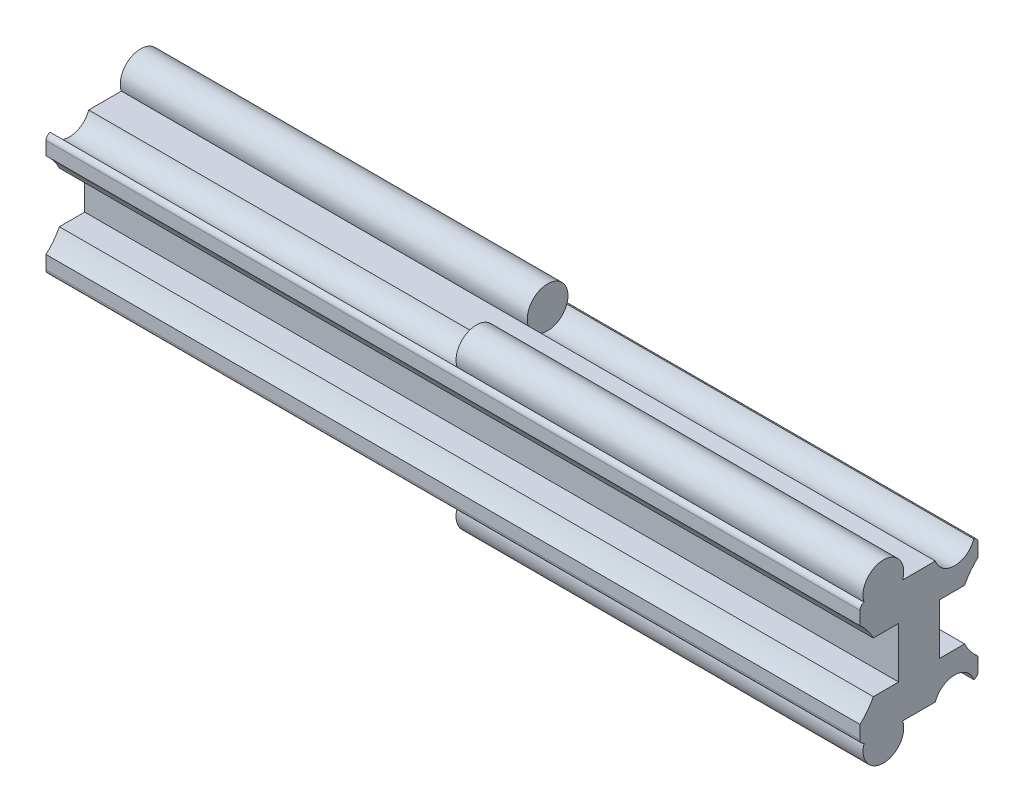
ISO-10303-21;
HEADER;
FILE_DESCRIPTION(('STEP AP214'),'2;1');
FILE_NAME('part.step','',(''),(''),'','','');
FILE_SCHEMA(('AUTOMOTIVE_DESIGN { 1 0 10303 214 1 1 1 1 }'));
ENDSEC;
DATA;
#1=APPLICATION_CONTEXT('core data for automotive mechanical design processes');
#2=APPLICATION_PROTOCOL_DEFINITION('international standard','automotive_design',2000,#1);
#3=PRODUCT_CONTEXT('',#1,'mechanical');
#4=PRODUCT('Part','Part','',(#3));
#5=PRODUCT_RELATED_PRODUCT_CATEGORY('part','',(#4));
#6=PRODUCT_DEFINITION_FORMATION('','',#4);
#7=PRODUCT_DEFINITION_CONTEXT('part definition',#1,'design');
#8=PRODUCT_DEFINITION('design','',#6,#7);
#9=PRODUCT_DEFINITION_SHAPE('','',#8);
#10=(LENGTH_UNIT() NAMED_UNIT(*) SI_UNIT(.MILLI.,.METRE.));
#11=(NAMED_UNIT(*) PLANE_ANGLE_UNIT() SI_UNIT($,.RADIAN.));
#12=(NAMED_UNIT(*) SI_UNIT($,.STERADIAN.) SOLID_ANGLE_UNIT());
#13=UNCERTAINTY_MEASURE_WITH_UNIT(LENGTH_MEASURE(1.E-05),#10,'distance_accuracy_value','');
#14=(GEOMETRIC_REPRESENTATION_CONTEXT(3) GLOBAL_UNCERTAINTY_ASSIGNED_CONTEXT((#13)) GLOBAL_UNIT_ASSIGNED_CONTEXT((#10,
#11,#12)) REPRESENTATION_CONTEXT('',''));
#15=CARTESIAN_POINT('',(0.,0.,0.));
#16=DIRECTION('',(0.,0.,1.));
#17=DIRECTION('',(1.,0.,0.));
#18=AXIS2_PLACEMENT_3D('',#15,#16,#17);
#19=CARTESIAN_POINT('',(40.,-6.65,3.49999999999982));
#20=DIRECTION('',(-1.,0.,0.));
#21=DIRECTION('',(0.,0.,1.));
#22=AXIS2_PLACEMENT_3D('',#19,#20,#21);
#23=CYLINDRICAL_SURFACE('',#22,2.);
#24=CARTESIAN_POINT('',(0.,-6.65,3.5));
#25=DIRECTION('',(1.,0.,0.));
#26=DIRECTION('',(0.,0.,-1.));
#27=AXIS2_PLACEMENT_3D('',#24,#25,#26);
#28=CIRCLE('',#27,2.);
#29=CARTESIAN_POINT('',(0.,-6.,1.60857196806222));
#30=VERTEX_POINT('',#29);
#31=CARTESIAN_POINT('',(0.,-5.99207212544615,5.38868496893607));
#32=VERTEX_POINT('',#31);
#33=EDGE_CURVE('E480',#30,#32,#28,.T.);
#34=ORIENTED_EDGE('',*,*,#33,.T.);
#35=DIRECTION('',(-1.,0.,0.));
#36=VECTOR('',#35,1.);
#37=CARTESIAN_POINT('',(0.,-5.99207212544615,5.38868496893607));
#38=LINE('',#37,#36);
#39=CARTESIAN_POINT('',(-40.,-5.99207212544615,5.38868496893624));
#40=VERTEX_POINT('',#39);
#41=EDGE_CURVE('E218',#32,#40,#38,.T.);
#42=ORIENTED_EDGE('',*,*,#41,.T.);
#43=CARTESIAN_POINT('',(-40.,-6.65,3.50000000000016));
#44=DIRECTION('',(-1.,0.,0.));
#45=DIRECTION('',(0.,0.,1.));
#46=AXIS2_PLACEMENT_3D('',#43,#44,#45);
#47=CIRCLE('',#46,2.);
#48=CARTESIAN_POINT('',(-40.,-6.,1.60857196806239));
#49=VERTEX_POINT('',#48);
#50=EDGE_CURVE('E387',#40,#49,#47,.T.);
#51=ORIENTED_EDGE('',*,*,#50,.T.);
#52=DIRECTION('',(-1.,0.,0.));
#53=VECTOR('',#52,1.);
#54=CARTESIAN_POINT('',(40.,-6.,1.60857196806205));
#55=LINE('',#54,#53);
#56=EDGE_CURVE('E393',#49,#30,#55,.F.);
#57=ORIENTED_EDGE('',*,*,#56,.T.);
#58=EDGE_LOOP('',(#34,#42,#51,#57));
#59=FACE_BOUND('',#58,.T.);
#60=ADVANCED_FACE('F14',(#59),#23,.F.);
#61=CARTESIAN_POINT('',(40.,6.65,3.49999999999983));
#62=DIRECTION('',(-1.,0.,0.));
#63=DIRECTION('',(0.,0.,1.));
#64=AXIS2_PLACEMENT_3D('',#61,#62,#63);
#65=CYLINDRICAL_SURFACE('',#64,2.);
#66=CARTESIAN_POINT('',(0.,6.65,3.5));
#67=DIRECTION('',(1.,0.,0.));
#68=DIRECTION('',(0.,0.,-1.));
#69=AXIS2_PLACEMENT_3D('',#66,#67,#68);
#70=CIRCLE('',#69,2.);
#71=CARTESIAN_POINT('',(0.,5.99207212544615,5.38868496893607));
#72=VERTEX_POINT('',#71);
#73=CARTESIAN_POINT('',(0.,6.,1.60857196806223));
#74=VERTEX_POINT('',#73);
#75=EDGE_CURVE('E474',#72,#74,#70,.T.);
#76=ORIENTED_EDGE('',*,*,#75,.T.);
#77=DIRECTION('',(-1.,0.,0.));
#78=VECTOR('',#77,1.);
#79=CARTESIAN_POINT('',(40.,6.,1.60857196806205));
#80=LINE('',#79,#78);
#81=CARTESIAN_POINT('',(-40.,6.,1.6085719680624));
#82=VERTEX_POINT('',#81);
#83=EDGE_CURVE('E22',#74,#82,#80,.T.);
#84=ORIENTED_EDGE('',*,*,#83,.T.);
#85=CARTESIAN_POINT('',(-40.,6.65,3.50000000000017));
#86=DIRECTION('',(-1.,0.,0.));
#87=DIRECTION('',(0.,0.,-1.));
#88=AXIS2_PLACEMENT_3D('',#85,#86,#87);
#89=CIRCLE('',#88,2.);
#90=CARTESIAN_POINT('',(-40.,5.99207212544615,5.38868496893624));
#91=VERTEX_POINT('',#90);
#92=EDGE_CURVE('E384',#82,#91,#89,.T.);
#93=ORIENTED_EDGE('',*,*,#92,.T.);
#94=DIRECTION('',(-1.,0.,0.));
#95=VECTOR('',#94,1.);
#96=CARTESIAN_POINT('',(0.,5.99207212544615,5.38868496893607));
#97=LINE('',#96,#95);
#98=EDGE_CURVE('E404',#91,#72,#97,.F.);
#99=ORIENTED_EDGE('',*,*,#98,.T.);
#100=EDGE_LOOP('',(#76,#84,#93,#99));
#101=FACE_BOUND('',#100,.T.);
#102=ADVANCED_FACE('F476',(#101),#65,.F.);
#103=CARTESIAN_POINT('',(40.,-6.65,-3.50000000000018));
#104=DIRECTION('',(-1.,0.,0.));
#105=DIRECTION('',(0.,0.,1.));
#106=AXIS2_PLACEMENT_3D('',#103,#104,#105);
#107=CYLINDRICAL_SURFACE('',#106,2.);
#108=CARTESIAN_POINT('',(0.,-6.65,-3.5));
#109=DIRECTION('',(-1.,0.,0.));
#110=DIRECTION('',(0.,0.,1.));
#111=AXIS2_PLACEMENT_3D('',#108,#109,#110);
#112=CIRCLE('',#111,2.);
#113=CARTESIAN_POINT('',(0.,-6.,-1.60857196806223));
#114=VERTEX_POINT('',#113);
#115=CARTESIAN_POINT('',(0.,-5.99207212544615,-5.38868496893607));
#116=VERTEX_POINT('',#115);
#117=EDGE_CURVE('E36',#114,#116,#112,.T.);
#118=ORIENTED_EDGE('',*,*,#117,.T.);
#119=DIRECTION('',(-1.,0.,0.));
#120=VECTOR('',#119,1.);
#121=CARTESIAN_POINT('',(0.,-5.99207212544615,-5.38868496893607));
#122=LINE('',#121,#120);
#123=CARTESIAN_POINT('',(40.,-5.99207212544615,-5.38868496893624));
#124=VERTEX_POINT('',#123);
#125=EDGE_CURVE('E396',#116,#124,#122,.F.);
#126=ORIENTED_EDGE('',*,*,#125,.T.);
#127=CARTESIAN_POINT('',(40.,-6.65,-3.50000000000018));
#128=DIRECTION('',(-1.,0.,0.));
#129=DIRECTION('',(0.,0.,-1.));
#130=AXIS2_PLACEMENT_3D('',#127,#128,#129);
#131=CIRCLE('',#130,2.);
#132=CARTESIAN_POINT('',(40.,-6.,-1.60857196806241));
#133=VERTEX_POINT('',#132);
#134=EDGE_CURVE('E389',#133,#124,#131,.T.);
#135=ORIENTED_EDGE('',*,*,#134,.F.);
#136=DIRECTION('',(-1.,0.,0.));
#137=VECTOR('',#136,1.);
#138=CARTESIAN_POINT('',(40.,-6.,-1.60857196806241));
#139=LINE('',#138,#137);
#140=EDGE_CURVE('E353',#133,#114,#139,.T.);
#141=ORIENTED_EDGE('',*,*,#140,.T.);
#142=EDGE_LOOP('',(#118,#126,#135,#141));
#143=FACE_BOUND('',#142,.T.);
#144=ADVANCED_FACE('F495',(#143),#107,.F.);
#145=CARTESIAN_POINT('',(40.,6.65,-3.50000000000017));
#146=DIRECTION('',(-1.,0.,0.));
#147=DIRECTION('',(0.,0.,1.));
#148=AXIS2_PLACEMENT_3D('',#145,#146,#147);
#149=CYLINDRICAL_SURFACE('',#148,2.);
#150=CARTESIAN_POINT('',(0.,6.65,-3.5));
#151=DIRECTION('',(-1.,0.,0.));
#152=DIRECTION('',(0.,0.,1.));
#153=AXIS2_PLACEMENT_3D('',#150,#151,#152);
#154=CIRCLE('',#153,2.);
#155=CARTESIAN_POINT('',(0.,5.99207212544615,-5.38868496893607));
#156=VERTEX_POINT('',#155);
#157=CARTESIAN_POINT('',(0.,6.,-1.60857196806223));
#158=VERTEX_POINT('',#157);
#159=EDGE_CURVE('E378',#156,#158,#154,.T.);
#160=ORIENTED_EDGE('',*,*,#159,.T.);
#161=DIRECTION('',(-1.,0.,0.));
#162=VECTOR('',#161,1.);
#163=CARTESIAN_POINT('',(40.,6.,-1.6085719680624));
#164=LINE('',#163,#162);
#165=CARTESIAN_POINT('',(40.,6.,-1.6085719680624));
#166=VERTEX_POINT('',#165);
#167=EDGE_CURVE('E400',#158,#166,#164,.F.);
#168=ORIENTED_EDGE('',*,*,#167,.T.);
#169=CARTESIAN_POINT('',(40.,6.65,-3.50000000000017));
#170=DIRECTION('',(-1.,0.,0.));
#171=DIRECTION('',(0.,0.,1.));
#172=AXIS2_PLACEMENT_3D('',#169,#170,#171);
#173=CIRCLE('',#172,2.);
#174=CARTESIAN_POINT('',(40.,5.99207212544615,-5.38868496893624));
#175=VERTEX_POINT('',#174);
#176=EDGE_CURVE('E386',#175,#166,#173,.T.);
#177=ORIENTED_EDGE('',*,*,#176,.F.);
#178=DIRECTION('',(-1.,0.,0.));
#179=VECTOR('',#178,1.);
#180=CARTESIAN_POINT('',(0.,5.99207212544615,-5.38868496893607));
#181=LINE('',#180,#179);
#182=EDGE_CURVE('E355',#175,#156,#181,.T.);
#183=ORIENTED_EDGE('',*,*,#182,.T.);
#184=EDGE_LOOP('',(#160,#168,#177,#183));
#185=FACE_BOUND('',#184,.T.);
#186=ADVANCED_FACE('F460',(#185),#149,.F.);
#187=CARTESIAN_POINT('',(-40.,5.24599995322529,-5.80000000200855));
#188=DIRECTION('',(0.,0.,1.));
#189=DIRECTION('',(0.,1.,0.));
#190=AXIS2_PLACEMENT_3D('',#187,#188,#189);
#191=PLANE('',#190);
#192=DIRECTION('',(1.,0.,0.));
#193=VECTOR('',#192,1.);
#194=CARTESIAN_POINT('',(-40.,4.19956991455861,-5.80000000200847));
#195=LINE('',#194,#193);
#196=CARTESIAN_POINT('',(-40.,4.19956991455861,-5.80000000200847));
#197=VERTEX_POINT('',#196);
#198=CARTESIAN_POINT('',(40.,4.19956991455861,-5.80000000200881));
#199=VERTEX_POINT('',#198);
#200=EDGE_CURVE('E350',#197,#199,#195,.T.);
#201=ORIENTED_EDGE('',*,*,#200,.F.);
#202=DIRECTION('',(0.,-1.,0.));
#203=VECTOR('',#202,1.);
#204=CARTESIAN_POINT('',(-40.,5.24599995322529,-5.80000000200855));
#205=LINE('',#204,#203);
#206=CARTESIAN_POINT('',(-40.,5.5,-5.80000000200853));
#207=VERTEX_POINT('',#206);
#208=EDGE_CURVE('E289',#207,#197,#205,.T.);
#209=ORIENTED_EDGE('',*,*,#208,.F.);
#210=DIRECTION('',(-1.,0.,0.));
#211=VECTOR('',#210,1.);
#212=CARTESIAN_POINT('',(51.7056202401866,5.5,-5.80000000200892));
#213=LINE('',#212,#211);
#214=CARTESIAN_POINT('',(40.,5.5,-5.80000000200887));
#215=VERTEX_POINT('',#214);
#216=EDGE_CURVE('E251',#215,#207,#213,.T.);
#217=ORIENTED_EDGE('',*,*,#216,.F.);
#218=DIRECTION('',(0.,-1.,0.));
#219=VECTOR('',#218,1.);
#220=CARTESIAN_POINT('',(40.,5.24599995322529,-5.80000000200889));
#221=LINE('',#220,#219);
#222=EDGE_CURVE('E260',#215,#199,#221,.T.);
#223=ORIENTED_EDGE('',*,*,#222,.T.);
#224=EDGE_LOOP('',(#201,#209,#217,#223));
#225=FACE_BOUND('',#224,.T.);
#226=ADVANCED_FACE('F16',(#225),#191,.F.);
#227=CARTESIAN_POINT('',(-40.,-0.00400000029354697,-9.49999999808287));
#228=DIRECTION('',(1.,0.,0.));
#229=DIRECTION('',(0.,0.,-1.));
#230=AXIS2_PLACEMENT_3D('',#227,#228,#229);
#231=CYLINDRICAL_SURFACE('',#230,5.6);
#232=CARTESIAN_POINT('',(40.,-0.00400000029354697,-9.49999999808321));
#233=DIRECTION('',(1.,0.,0.));
#234=DIRECTION('',(0.,0.,1.));
#235=AXIS2_PLACEMENT_3D('',#232,#233,#234);
#236=CIRCLE('',#235,5.6);
#237=CARTESIAN_POINT('',(40.,2.49600003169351,-4.48901208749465));
#238=VERTEX_POINT('',#237);
#239=EDGE_CURVE('E264',#199,#238,#236,.T.);
#240=ORIENTED_EDGE('',*,*,#239,.T.);
#241=DIRECTION('',(1.,0.,0.));
#242=VECTOR('',#241,1.);
#243=CARTESIAN_POINT('',(-40.,2.49600003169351,-4.4890120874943));
#244=LINE('',#243,#242);
#245=CARTESIAN_POINT('',(-40.,2.49600003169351,-4.4890120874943));
#246=VERTEX_POINT('',#245);
#247=EDGE_CURVE('E347',#246,#238,#244,.T.);
#248=ORIENTED_EDGE('',*,*,#247,.F.);
#249=CARTESIAN_POINT('',(-40.,-0.00400000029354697,-9.49999999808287));
#250=DIRECTION('',(1.,0.,0.));
#251=DIRECTION('',(0.,0.,1.));
#252=AXIS2_PLACEMENT_3D('',#249,#250,#251);
#253=CIRCLE('',#252,5.6);
#254=EDGE_CURVE('E291',#197,#246,#253,.T.);
#255=ORIENTED_EDGE('',*,*,#254,.F.);
#256=ORIENTED_EDGE('',*,*,#200,.T.);
#257=EDGE_LOOP('',(#240,#248,#255,#256));
#258=FACE_BOUND('',#257,.T.);
#259=ADVANCED_FACE('F554',(#258),#231,.F.);
#260=CARTESIAN_POINT('',(-40.,2.49600003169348,-4.48901208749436));
#261=DIRECTION('',(0.,1.,1.28513155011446E-08));
#262=DIRECTION('',(0.,1.28513155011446E-08,-1.));
#263=AXIS2_PLACEMENT_3D('',#260,#261,#262);
#264=PLANE('',#263);
#265=DIRECTION('',(0.,-1.28513155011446E-08,1.));
#266=VECTOR('',#265,1.);
#267=CARTESIAN_POINT('',(40.,2.49600003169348,-4.4890120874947));
#268=LINE('',#267,#266);
#269=CARTESIAN_POINT('',(40.,2.4959999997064,-1.99999999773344));
#270=VERTEX_POINT('',#269);
#271=EDGE_CURVE('E266',#238,#270,#268,.T.);
#272=ORIENTED_EDGE('',*,*,#271,.T.);
#273=DIRECTION('',(1.,0.,0.));
#274=VECTOR('',#273,1.);
#275=CARTESIAN_POINT('',(-40.,2.4959999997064,-1.99999999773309));
#276=LINE('',#275,#274);
#277=CARTESIAN_POINT('',(-40.,2.4959999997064,-1.99999999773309));
#278=VERTEX_POINT('',#277);
#279=EDGE_CURVE('E344',#278,#270,#276,.T.);
#280=ORIENTED_EDGE('',*,*,#279,.F.);
#281=DIRECTION('',(0.,-1.28513155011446E-08,1.));
#282=VECTOR('',#281,1.);
#283=CARTESIAN_POINT('',(-40.,2.49600003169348,-4.48901208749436));
#284=LINE('',#283,#282);
#285=EDGE_CURVE('E293',#246,#278,#284,.T.);
#286=ORIENTED_EDGE('',*,*,#285,.F.);
#287=ORIENTED_EDGE('',*,*,#247,.T.);
#288=EDGE_LOOP('',(#272,#280,#286,#287));
#289=FACE_BOUND('',#288,.T.);
#290=ADVANCED_FACE('F551',(#289),#264,.F.);
#291=CARTESIAN_POINT('',(-40.,2.4959999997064,-1.99999999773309));
#292=DIRECTION('',(0.,0.,1.));
#293=DIRECTION('',(1.,0.,0.));
#294=AXIS2_PLACEMENT_3D('',#291,#292,#293);
#295=PLANE('',#294);
#296=DIRECTION('',(0.,-1.,0.));
#297=VECTOR('',#296,1.);
#298=CARTESIAN_POINT('',(40.,2.4959999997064,-1.99999999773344));
#299=LINE('',#298,#297);
#300=CARTESIAN_POINT('',(40.,-2.4959999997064,-1.99999999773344));
#301=VERTEX_POINT('',#300);
#302=EDGE_CURVE('E268',#270,#301,#299,.T.);
#303=ORIENTED_EDGE('',*,*,#302,.T.);
#304=DIRECTION('',(1.,0.,0.));
#305=VECTOR('',#304,1.);
#306=CARTESIAN_POINT('',(-40.,-2.4959999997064,-1.99999999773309));
#307=LINE('',#306,#305);
#308=CARTESIAN_POINT('',(-40.,-2.4959999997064,-1.99999999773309));
#309=VERTEX_POINT('',#308);
#310=EDGE_CURVE('E341',#309,#301,#307,.T.);
#311=ORIENTED_EDGE('',*,*,#310,.F.);
#312=DIRECTION('',(0.,-1.,0.));
#313=VECTOR('',#312,1.);
#314=CARTESIAN_POINT('',(-40.,2.4959999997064,-1.99999999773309));
#315=LINE('',#314,#313);
#316=EDGE_CURVE('E295',#278,#309,#315,.T.);
#317=ORIENTED_EDGE('',*,*,#316,.F.);
#318=ORIENTED_EDGE('',*,*,#279,.T.);
#319=EDGE_LOOP('',(#303,#311,#317,#318));
#320=FACE_BOUND('',#319,.T.);
#321=ADVANCED_FACE('F547',(#320),#295,.F.);
#322=CARTESIAN_POINT('',(-40.,-2.49600003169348,-4.48901208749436));
#323=DIRECTION('',(0.,-1.,1.28513155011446E-08));
#324=DIRECTION('',(0.,1.28513155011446E-08,1.));
#325=AXIS2_PLACEMENT_3D('',#322,#323,#324);
#326=PLANE('',#325);
#327=DIRECTION('',(0.,-1.28513155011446E-08,-1.));
#328=VECTOR('',#327,1.);
#329=CARTESIAN_POINT('',(40.,-2.49600003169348,-4.4890120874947));
#330=LINE('',#329,#328);
#331=CARTESIAN_POINT('',(40.,-2.49600003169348,-4.4890120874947));
#332=VERTEX_POINT('',#331);
#333=EDGE_CURVE('E270',#301,#332,#330,.T.);
#334=ORIENTED_EDGE('',*,*,#333,.T.);
#335=DIRECTION('',(1.,0.,0.));
#336=VECTOR('',#335,1.);
#337=CARTESIAN_POINT('',(-40.,-2.49600003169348,-4.48901208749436));
#338=LINE('',#337,#336);
#339=CARTESIAN_POINT('',(-40.,-2.49600003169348,-4.48901208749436));
#340=VERTEX_POINT('',#339);
#341=EDGE_CURVE('E338',#340,#332,#338,.T.);
#342=ORIENTED_EDGE('',*,*,#341,.F.);
#343=DIRECTION('',(0.,-1.28513155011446E-08,-1.));
#344=VECTOR('',#343,1.);
#345=CARTESIAN_POINT('',(-40.,-2.49600003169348,-4.48901208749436));
#346=LINE('',#345,#344);
#347=EDGE_CURVE('E297',#309,#340,#346,.T.);
#348=ORIENTED_EDGE('',*,*,#347,.F.);
#349=ORIENTED_EDGE('',*,*,#310,.T.);
#350=EDGE_LOOP('',(#334,#342,#348,#349));
#351=FACE_BOUND('',#350,.T.);
#352=ADVANCED_FACE('F543',(#351),#326,.F.);
#353=CARTESIAN_POINT('',(-40.,0.00400000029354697,-9.49999999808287));
#354=DIRECTION('',(1.,0.,0.));
#355=DIRECTION('',(0.,0.,-1.));
#356=AXIS2_PLACEMENT_3D('',#353,#354,#355);
#357=CYLINDRICAL_SURFACE('',#356,5.6);
#358=CARTESIAN_POINT('',(40.,0.00400000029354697,-9.49999999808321));
#359=DIRECTION('',(1.,0.,0.));
#360=DIRECTION('',(0.,0.,-1.));
#361=AXIS2_PLACEMENT_3D('',#358,#359,#360);
#362=CIRCLE('',#361,5.6);
#363=CARTESIAN_POINT('',(40.,-4.19956991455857,-5.80000000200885));
#364=VERTEX_POINT('',#363);
#365=EDGE_CURVE('E272',#332,#364,#362,.T.);
#366=ORIENTED_EDGE('',*,*,#365,.T.);
#367=DIRECTION('',(1.,0.,0.));
#368=VECTOR('',#367,1.);
#369=CARTESIAN_POINT('',(-40.,-4.19956991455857,-5.80000000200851));
#370=LINE('',#369,#368);
#371=CARTESIAN_POINT('',(-40.,-4.19956991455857,-5.80000000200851));
#372=VERTEX_POINT('',#371);
#373=EDGE_CURVE('E335',#372,#364,#370,.T.);
#374=ORIENTED_EDGE('',*,*,#373,.F.);
#375=CARTESIAN_POINT('',(-40.,0.00400000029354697,-9.49999999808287));
#376=DIRECTION('',(1.,0.,0.));
#377=DIRECTION('',(0.,0.,-1.));
#378=AXIS2_PLACEMENT_3D('',#375,#376,#377);
#379=CIRCLE('',#378,5.6);
#380=EDGE_CURVE('E299',#340,#372,#379,.T.);
#381=ORIENTED_EDGE('',*,*,#380,.F.);
#382=ORIENTED_EDGE('',*,*,#341,.T.);
#383=EDGE_LOOP('',(#366,#374,#381,#382));
#384=FACE_BOUND('',#383,.T.);
#385=ADVANCED_FACE('F539',(#384),#357,.F.);
#386=CARTESIAN_POINT('',(-40.,-5.24599995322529,-5.80000000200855));
#387=DIRECTION('',(0.,0.,1.));
#388=DIRECTION('',(0.,1.,0.));
#389=AXIS2_PLACEMENT_3D('',#386,#387,#388);
#390=PLANE('',#389);
#391=DIRECTION('',(0.,-1.,0.));
#392=VECTOR('',#391,1.);
#393=CARTESIAN_POINT('',(40.,-5.24599995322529,-5.80000000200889));
#394=LINE('',#393,#392);
#395=CARTESIAN_POINT('',(40.,-5.5,-5.80000000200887));
#396=VERTEX_POINT('',#395);
#397=EDGE_CURVE('E274',#364,#396,#394,.T.);
#398=ORIENTED_EDGE('',*,*,#397,.T.);
#399=DIRECTION('',(-1.,0.,0.));
#400=VECTOR('',#399,1.);
#401=CARTESIAN_POINT('',(51.7056202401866,-5.5,-5.80000000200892));
#402=LINE('',#401,#400);
#403=CARTESIAN_POINT('',(-40.,-5.5,-5.80000000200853));
#404=VERTEX_POINT('',#403);
#405=EDGE_CURVE('E238',#396,#404,#402,.T.);
#406=ORIENTED_EDGE('',*,*,#405,.T.);
#407=DIRECTION('',(0.,-1.,0.));
#408=VECTOR('',#407,1.);
#409=CARTESIAN_POINT('',(-40.,-5.24599995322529,-5.80000000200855));
#410=LINE('',#409,#408);
#411=EDGE_CURVE('E301',#372,#404,#410,.T.);
#412=ORIENTED_EDGE('',*,*,#411,.F.);
#413=ORIENTED_EDGE('',*,*,#373,.T.);
#414=EDGE_LOOP('',(#398,#406,#412,#413));
#415=FACE_BOUND('',#414,.T.);
#416=ADVANCED_FACE('F536',(#415),#390,.F.);
#417=CARTESIAN_POINT('',(-40.,-5.24599995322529,5.80000000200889));
#418=DIRECTION('',(0.,0.,-1.));
#419=DIRECTION('',(0.,-1.,0.));
#420=AXIS2_PLACEMENT_3D('',#417,#418,#419);
#421=PLANE('',#420);
#422=DIRECTION('',(1.,0.,0.));
#423=VECTOR('',#422,1.);
#424=CARTESIAN_POINT('',(-40.,-4.19956991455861,5.80000000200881));
#425=LINE('',#424,#423);
#426=CARTESIAN_POINT('',(-40.,-4.19956991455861,5.80000000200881));
#427=VERTEX_POINT('',#426);
#428=CARTESIAN_POINT('',(40.,-4.19956991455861,5.80000000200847));
#429=VERTEX_POINT('',#428);
#430=EDGE_CURVE('E332',#427,#429,#425,.T.);
#431=ORIENTED_EDGE('',*,*,#430,.F.);
#432=DIRECTION('',(0.,1.,0.));
#433=VECTOR('',#432,1.);
#434=CARTESIAN_POINT('',(-40.,-5.24599995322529,5.80000000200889));
#435=LINE('',#434,#433);
#436=CARTESIAN_POINT('',(-40.,-5.5,5.80000000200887));
#437=VERTEX_POINT('',#436);
#438=EDGE_CURVE('E303',#437,#427,#435,.T.);
#439=ORIENTED_EDGE('',*,*,#438,.F.);
#440=DIRECTION('',(-1.,0.,0.));
#441=VECTOR('',#440,1.);
#442=CARTESIAN_POINT('',(51.7056202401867,-5.5,5.80000000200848));
#443=LINE('',#442,#441);
#444=CARTESIAN_POINT('',(40.,-5.5,5.80000000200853));
#445=VERTEX_POINT('',#444);
#446=EDGE_CURVE('E225',#445,#437,#443,.T.);
#447=ORIENTED_EDGE('',*,*,#446,.F.);
#448=DIRECTION('',(0.,1.,0.));
#449=VECTOR('',#448,1.);
#450=CARTESIAN_POINT('',(40.,-5.24599995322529,5.80000000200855));
#451=LINE('',#450,#449);
#452=EDGE_CURVE('E223',#445,#429,#451,.T.);
#453=ORIENTED_EDGE('',*,*,#452,.T.);
#454=EDGE_LOOP('',(#431,#439,#447,#453));
#455=FACE_BOUND('',#454,.T.);
#456=ADVANCED_FACE('F416',(#455),#421,.F.);
#457=CARTESIAN_POINT('',(-40.,0.00400000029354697,9.49999999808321));
#458=DIRECTION('',(1.,0.,0.));
#459=DIRECTION('',(0.,0.,-1.));
#460=AXIS2_PLACEMENT_3D('',#457,#458,#459);
#461=CYLINDRICAL_SURFACE('',#460,5.6);
#462=CARTESIAN_POINT('',(40.,0.00400000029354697,9.49999999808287));
#463=DIRECTION('',(1.,0.,0.));
#464=DIRECTION('',(0.,0.,1.));
#465=AXIS2_PLACEMENT_3D('',#462,#463,#464);
#466=CIRCLE('',#465,5.6);
#467=CARTESIAN_POINT('',(40.,-2.49600003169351,4.4890120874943));
#468=VERTEX_POINT('',#467);
#469=EDGE_CURVE('E277',#429,#468,#466,.T.);
#470=ORIENTED_EDGE('',*,*,#469,.T.);
#471=DIRECTION('',(1.,0.,0.));
#472=VECTOR('',#471,1.);
#473=CARTESIAN_POINT('',(-40.,-2.49600003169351,4.48901208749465));
#474=LINE('',#473,#472);
#475=CARTESIAN_POINT('',(-40.,-2.49600003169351,4.48901208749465));
#476=VERTEX_POINT('',#475);
#477=EDGE_CURVE('E329',#476,#468,#474,.T.);
#478=ORIENTED_EDGE('',*,*,#477,.F.);
#479=CARTESIAN_POINT('',(-40.,0.00400000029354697,9.49999999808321));
#480=DIRECTION('',(1.,0.,0.));
#481=DIRECTION('',(0.,0.,1.));
#482=AXIS2_PLACEMENT_3D('',#479,#480,#481);
#483=CIRCLE('',#482,5.6);
#484=EDGE_CURVE('E305',#427,#476,#483,.T.);
#485=ORIENTED_EDGE('',*,*,#484,.F.);
#486=ORIENTED_EDGE('',*,*,#430,.T.);
#487=EDGE_LOOP('',(#470,#478,#485,#486));
#488=FACE_BOUND('',#487,.T.);
#489=ADVANCED_FACE('F420',(#488),#461,.F.);
#490=CARTESIAN_POINT('',(-40.,-2.49600003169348,4.4890120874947));
#491=DIRECTION('',(0.,-1.,-1.28513155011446E-08));
#492=DIRECTION('',(0.,-1.28513155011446E-08,1.));
#493=AXIS2_PLACEMENT_3D('',#490,#491,#492);
#494=PLANE('',#493);
#495=DIRECTION('',(0.,1.28513155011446E-08,-1.));
#496=VECTOR('',#495,1.);
#497=CARTESIAN_POINT('',(40.,-2.49600003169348,4.48901208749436));
#498=LINE('',#497,#496);
#499=CARTESIAN_POINT('',(40.,-2.4959999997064,1.99999999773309));
#500=VERTEX_POINT('',#499);
#501=EDGE_CURVE('E279',#468,#500,#498,.T.);
#502=ORIENTED_EDGE('',*,*,#501,.T.);
#503=DIRECTION('',(1.,0.,0.));
#504=VECTOR('',#503,1.);
#505=CARTESIAN_POINT('',(-40.,-2.4959999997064,1.99999999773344));
#506=LINE('',#505,#504);
#507=CARTESIAN_POINT('',(-40.,-2.4959999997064,1.99999999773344));
#508=VERTEX_POINT('',#507);
#509=EDGE_CURVE('E326',#508,#500,#506,.T.);
#510=ORIENTED_EDGE('',*,*,#509,.F.);
#511=DIRECTION('',(0.,1.28513155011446E-08,-1.));
#512=VECTOR('',#511,1.);
#513=CARTESIAN_POINT('',(-40.,-2.49600003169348,4.4890120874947));
#514=LINE('',#513,#512);
#515=EDGE_CURVE('E307',#476,#508,#514,.T.);
#516=ORIENTED_EDGE('',*,*,#515,.F.);
#517=ORIENTED_EDGE('',*,*,#477,.T.);
#518=EDGE_LOOP('',(#502,#510,#516,#517));
#519=FACE_BOUND('',#518,.T.);
#520=ADVANCED_FACE('F426',(#519),#494,.F.);
#521=CARTESIAN_POINT('',(-40.,2.4959999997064,1.99999999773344));
#522=DIRECTION('',(0.,0.,-1.));
#523=DIRECTION('',(-1.,0.,0.));
#524=AXIS2_PLACEMENT_3D('',#521,#522,#523);
#525=PLANE('',#524);
#526=DIRECTION('',(0.,1.,0.));
#527=VECTOR('',#526,1.);
#528=CARTESIAN_POINT('',(40.,2.4959999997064,1.99999999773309));
#529=LINE('',#528,#527);
#530=CARTESIAN_POINT('',(40.,2.4959999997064,1.99999999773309));
#531=VERTEX_POINT('',#530);
#532=EDGE_CURVE('E281',#500,#531,#529,.T.);
#533=ORIENTED_EDGE('',*,*,#532,.T.);
#534=DIRECTION('',(1.,0.,0.));
#535=VECTOR('',#534,1.);
#536=CARTESIAN_POINT('',(-40.,2.4959999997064,1.99999999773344));
#537=LINE('',#536,#535);
#538=CARTESIAN_POINT('',(-40.,2.4959999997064,1.99999999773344));
#539=VERTEX_POINT('',#538);
#540=EDGE_CURVE('E323',#539,#531,#537,.T.);
#541=ORIENTED_EDGE('',*,*,#540,.F.);
#542=DIRECTION('',(0.,1.,0.));
#543=VECTOR('',#542,1.);
#544=CARTESIAN_POINT('',(-40.,2.4959999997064,1.99999999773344));
#545=LINE('',#544,#543);
#546=EDGE_CURVE('E309',#508,#539,#545,.T.);
#547=ORIENTED_EDGE('',*,*,#546,.F.);
#548=ORIENTED_EDGE('',*,*,#509,.T.);
#549=EDGE_LOOP('',(#533,#541,#547,#548));
#550=FACE_BOUND('',#549,.T.);
#551=ADVANCED_FACE('F430',(#550),#525,.F.);
#552=CARTESIAN_POINT('',(-40.,2.49600003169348,4.4890120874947));
#553=DIRECTION('',(0.,1.,-1.28513155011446E-08));
#554=DIRECTION('',(0.,-1.28513155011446E-08,-1.));
#555=AXIS2_PLACEMENT_3D('',#552,#553,#554);
#556=PLANE('',#555);
#557=DIRECTION('',(0.,1.28513155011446E-08,1.));
#558=VECTOR('',#557,1.);
#559=CARTESIAN_POINT('',(40.,2.49600003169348,4.48901208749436));
#560=LINE('',#559,#558);
#561=CARTESIAN_POINT('',(40.,2.49600003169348,4.48901208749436));
#562=VERTEX_POINT('',#561);
#563=EDGE_CURVE('E283',#531,#562,#560,.T.);
#564=ORIENTED_EDGE('',*,*,#563,.T.);
#565=DIRECTION('',(1.,0.,0.));
#566=VECTOR('',#565,1.);
#567=CARTESIAN_POINT('',(-40.,2.49600003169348,4.4890120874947));
#568=LINE('',#567,#566);
#569=CARTESIAN_POINT('',(-40.,2.49600003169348,4.4890120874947));
#570=VERTEX_POINT('',#569);
#571=EDGE_CURVE('E320',#570,#562,#568,.T.);
#572=ORIENTED_EDGE('',*,*,#571,.F.);
#573=DIRECTION('',(0.,1.28513155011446E-08,1.));
#574=VECTOR('',#573,1.);
#575=CARTESIAN_POINT('',(-40.,2.49600003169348,4.4890120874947));
#576=LINE('',#575,#574);
#577=EDGE_CURVE('E311',#539,#570,#576,.T.);
#578=ORIENTED_EDGE('',*,*,#577,.F.);
#579=ORIENTED_EDGE('',*,*,#540,.T.);
#580=EDGE_LOOP('',(#564,#572,#578,#579));
#581=FACE_BOUND('',#580,.T.);
#582=ADVANCED_FACE('F435',(#581),#556,.F.);
#583=CARTESIAN_POINT('',(-40.,-0.00400000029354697,9.49999999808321));
#584=DIRECTION('',(1.,0.,0.));
#585=DIRECTION('',(0.,0.,-1.));
#586=AXIS2_PLACEMENT_3D('',#583,#584,#585);
#587=CYLINDRICAL_SURFACE('',#586,5.6);
#588=CARTESIAN_POINT('',(40.,-0.00400000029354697,9.49999999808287));
#589=DIRECTION('',(1.,0.,0.));
#590=DIRECTION('',(0.,0.,-1.));
#591=AXIS2_PLACEMENT_3D('',#588,#589,#590);
#592=CIRCLE('',#591,5.6);
#593=CARTESIAN_POINT('',(40.,4.19956991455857,5.80000000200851));
#594=VERTEX_POINT('',#593);
#595=EDGE_CURVE('E285',#562,#594,#592,.T.);
#596=ORIENTED_EDGE('',*,*,#595,.T.);
#597=DIRECTION('',(1.,0.,0.));
#598=VECTOR('',#597,1.);
#599=CARTESIAN_POINT('',(-40.,4.19956991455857,5.80000000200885));
#600=LINE('',#599,#598);
#601=CARTESIAN_POINT('',(-40.,4.19956991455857,5.80000000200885));
#602=VERTEX_POINT('',#601);
#603=EDGE_CURVE('E317',#602,#594,#600,.T.);
#604=ORIENTED_EDGE('',*,*,#603,.F.);
#605=CARTESIAN_POINT('',(-40.,-0.00400000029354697,9.49999999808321));
#606=DIRECTION('',(1.,0.,0.));
#607=DIRECTION('',(0.,0.,-1.));
#608=AXIS2_PLACEMENT_3D('',#605,#606,#607);
#609=CIRCLE('',#608,5.6);
#610=EDGE_CURVE('E313',#570,#602,#609,.T.);
#611=ORIENTED_EDGE('',*,*,#610,.F.);
#612=ORIENTED_EDGE('',*,*,#571,.T.);
#613=EDGE_LOOP('',(#596,#604,#611,#612));
#614=FACE_BOUND('',#613,.T.);
#615=ADVANCED_FACE('F440',(#614),#587,.F.);
#616=CARTESIAN_POINT('',(-40.,5.24599995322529,5.80000000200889));
#617=DIRECTION('',(0.,0.,-1.));
#618=DIRECTION('',(0.,-1.,0.));
#619=AXIS2_PLACEMENT_3D('',#616,#617,#618);
#620=PLANE('',#619);
#621=DIRECTION('',(0.,1.,0.));
#622=VECTOR('',#621,1.);
#623=CARTESIAN_POINT('',(40.,5.24599995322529,5.80000000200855));
#624=LINE('',#623,#622);
#625=CARTESIAN_POINT('',(40.,5.5,5.80000000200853));
#626=VERTEX_POINT('',#625);
#627=EDGE_CURVE('E287',#594,#626,#624,.T.);
#628=ORIENTED_EDGE('',*,*,#627,.T.);
#629=DIRECTION('',(-1.,0.,0.));
#630=VECTOR('',#629,1.);
#631=CARTESIAN_POINT('',(51.7056202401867,5.5,5.80000000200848));
#632=LINE('',#631,#630);
#633=CARTESIAN_POINT('',(-40.,5.5,5.80000000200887));
#634=VERTEX_POINT('',#633);
#635=EDGE_CURVE('E244',#626,#634,#632,.T.);
#636=ORIENTED_EDGE('',*,*,#635,.T.);
#637=DIRECTION('',(0.,1.,0.));
#638=VECTOR('',#637,1.);
#639=CARTESIAN_POINT('',(-40.,5.24599995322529,5.80000000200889));
#640=LINE('',#639,#638);
#641=EDGE_CURVE('E315',#602,#634,#640,.T.);
#642=ORIENTED_EDGE('',*,*,#641,.F.);
#643=ORIENTED_EDGE('',*,*,#603,.T.);
#644=EDGE_LOOP('',(#628,#636,#642,#643));
#645=FACE_BOUND('',#644,.T.);
#646=ADVANCED_FACE('F444',(#645),#620,.F.);
#647=CARTESIAN_POINT('',(-40.,5.24599995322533,-5.30000000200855));
#648=DIRECTION('',(1.,0.,0.));
#649=DIRECTION('',(0.,0.,-1.));
#650=AXIS2_PLACEMENT_3D('',#647,#648,#649);
#651=PLANE('',#650);
#652=CARTESIAN_POINT('',(-40.,-5.5,-5.30000000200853));
#653=DIRECTION('',(-1.,0.,0.));
#654=DIRECTION('',(0.,0.,1.));
#655=AXIS2_PLACEMENT_3D('',#652,#653,#654);
#656=CIRCLE('',#655,0.5);
#657=CARTESIAN_POINT('',(-40.,-5.99207212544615,-5.3886849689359));
#658=VERTEX_POINT('',#657);
#659=EDGE_CURVE('E408',#404,#658,#656,.T.);
#660=ORIENTED_EDGE('',*,*,#659,.T.);
#661=CARTESIAN_POINT('',(-40.,-6.65,-3.49999999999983));
#662=DIRECTION('',(-1.,0.,0.));
#663=DIRECTION('',(0.,0.,1.));
#664=AXIS2_PLACEMENT_3D('',#661,#662,#663);
#665=CIRCLE('',#664,2.);
#666=CARTESIAN_POINT('',(-40.,-6.,-1.60857196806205));
#667=VERTEX_POINT('',#666);
#668=EDGE_CURVE('E477',#658,#667,#665,.T.);
#669=ORIENTED_EDGE('',*,*,#668,.T.);
#670=DIRECTION('',(0.,0.,1.));
#671=VECTOR('',#670,1.);
#672=CARTESIAN_POINT('',(-40.,-6.,-5.30000000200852));
#673=LINE('',#672,#671);
#674=EDGE_CURVE('E240',#667,#49,#673,.T.);
#675=ORIENTED_EDGE('',*,*,#674,.T.);
#676=ORIENTED_EDGE('',*,*,#50,.F.);
#677=CARTESIAN_POINT('',(-40.,-5.5,5.30000000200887));
#678=DIRECTION('',(-1.,0.,0.));
#679=DIRECTION('',(0.,0.,1.));
#680=AXIS2_PLACEMENT_3D('',#677,#678,#679);
#681=CIRCLE('',#680,0.5);
#682=EDGE_CURVE('E233',#40,#437,#681,.T.);
#683=ORIENTED_EDGE('',*,*,#682,.T.);
#684=ORIENTED_EDGE('',*,*,#438,.T.);
#685=ORIENTED_EDGE('',*,*,#484,.T.);
#686=ORIENTED_EDGE('',*,*,#515,.T.);
#687=ORIENTED_EDGE('',*,*,#546,.T.);
#688=ORIENTED_EDGE('',*,*,#577,.T.);
#689=ORIENTED_EDGE('',*,*,#610,.T.);
#690=ORIENTED_EDGE('',*,*,#641,.T.);
#691=CARTESIAN_POINT('',(-40.,5.5,5.30000000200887));
#692=DIRECTION('',(-1.,0.,0.));
#693=DIRECTION('',(0.,0.,-1.));
#694=AXIS2_PLACEMENT_3D('',#691,#692,#693);
#695=CIRCLE('',#694,0.5);
#696=EDGE_CURVE('E228',#634,#91,#695,.T.);
#697=ORIENTED_EDGE('',*,*,#696,.T.);
#698=ORIENTED_EDGE('',*,*,#92,.F.);
#699=DIRECTION('',(0.,0.,-1.));
#700=VECTOR('',#699,1.);
#701=CARTESIAN_POINT('',(-40.,6.,-5.30000000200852));
#702=LINE('',#701,#700);
#703=CARTESIAN_POINT('',(-40.,6.,-1.60857196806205));
#704=VERTEX_POINT('',#703);
#705=EDGE_CURVE('E245',#82,#704,#702,.T.);
#706=ORIENTED_EDGE('',*,*,#705,.T.);
#707=CARTESIAN_POINT('',(-40.,6.65,-3.49999999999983));
#708=DIRECTION('',(-1.,0.,0.));
#709=DIRECTION('',(0.,0.,1.));
#710=AXIS2_PLACEMENT_3D('',#707,#708,#709);
#711=CIRCLE('',#710,2.);
#712=CARTESIAN_POINT('',(-40.,5.99207212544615,-5.3886849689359));
#713=VERTEX_POINT('',#712);
#714=EDGE_CURVE('E366',#704,#713,#711,.T.);
#715=ORIENTED_EDGE('',*,*,#714,.T.);
#716=CARTESIAN_POINT('',(-40.,5.5,-5.30000000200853));
#717=DIRECTION('',(-1.,0.,0.));
#718=DIRECTION('',(0.,0.,-1.));
#719=AXIS2_PLACEMENT_3D('',#716,#717,#718);
#720=CIRCLE('',#719,0.5);
#721=EDGE_CURVE('E242',#713,#207,#720,.T.);
#722=ORIENTED_EDGE('',*,*,#721,.T.);
#723=ORIENTED_EDGE('',*,*,#208,.T.);
#724=ORIENTED_EDGE('',*,*,#254,.T.);
#725=ORIENTED_EDGE('',*,*,#285,.T.);
#726=ORIENTED_EDGE('',*,*,#316,.T.);
#727=ORIENTED_EDGE('',*,*,#347,.T.);
#728=ORIENTED_EDGE('',*,*,#380,.T.);
#729=ORIENTED_EDGE('',*,*,#411,.T.);
#730=EDGE_LOOP('',(#660,#669,#675,#676,#683,#684,#685,#686,#687,#688,#689,#690,#697,#698,#706,
#715,#722,#723,#724,#725,#726,#727,#728,#729));
#731=FACE_BOUND('',#730,.T.);
#732=ADVANCED_FACE('F372',(#731),#651,.F.);
#733=CARTESIAN_POINT('',(40.,5.24599995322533,-5.30000000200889));
#734=DIRECTION('',(1.,0.,0.));
#735=DIRECTION('',(0.,0.,-1.));
#736=AXIS2_PLACEMENT_3D('',#733,#734,#735);
#737=PLANE('',#736);
#738=ORIENTED_EDGE('',*,*,#134,.T.);
#739=CARTESIAN_POINT('',(40.,-5.5,-5.30000000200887));
#740=DIRECTION('',(1.,0.,0.));
#741=DIRECTION('',(0.,0.,-1.));
#742=AXIS2_PLACEMENT_3D('',#739,#740,#741);
#743=CIRCLE('',#742,0.5);
#744=EDGE_CURVE('E230',#396,#124,#743,.F.);
#745=ORIENTED_EDGE('',*,*,#744,.F.);
#746=ORIENTED_EDGE('',*,*,#397,.F.);
#747=ORIENTED_EDGE('',*,*,#365,.F.);
#748=ORIENTED_EDGE('',*,*,#333,.F.);
#749=ORIENTED_EDGE('',*,*,#302,.F.);
#750=ORIENTED_EDGE('',*,*,#271,.F.);
#751=ORIENTED_EDGE('',*,*,#239,.F.);
#752=ORIENTED_EDGE('',*,*,#222,.F.);
#753=CARTESIAN_POINT('',(40.,5.5,-5.30000000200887));
#754=DIRECTION('',(1.,0.,0.));
#755=DIRECTION('',(0.,0.,-1.));
#756=AXIS2_PLACEMENT_3D('',#753,#754,#755);
#757=CIRCLE('',#756,0.5);
#758=EDGE_CURVE('E249',#175,#215,#757,.F.);
#759=ORIENTED_EDGE('',*,*,#758,.F.);
#760=ORIENTED_EDGE('',*,*,#176,.T.);
#761=DIRECTION('',(0.,0.,-1.));
#762=VECTOR('',#761,1.);
#763=CARTESIAN_POINT('',(40.,6.,-5.30000000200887));
#764=LINE('',#763,#762);
#765=CARTESIAN_POINT('',(40.,6.,1.60857196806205));
#766=VERTEX_POINT('',#765);
#767=EDGE_CURVE('E252',#766,#166,#764,.T.);
#768=ORIENTED_EDGE('',*,*,#767,.F.);
#769=CARTESIAN_POINT('',(40.,6.65,3.49999999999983));
#770=DIRECTION('',(1.,0.,0.));
#771=DIRECTION('',(0.,0.,-1.));
#772=AXIS2_PLACEMENT_3D('',#769,#770,#771);
#773=CIRCLE('',#772,2.);
#774=CARTESIAN_POINT('',(40.,5.99207212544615,5.3886849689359));
#775=VERTEX_POINT('',#774);
#776=EDGE_CURVE('E470',#766,#775,#773,.T.);
#777=ORIENTED_EDGE('',*,*,#776,.T.);
#778=CARTESIAN_POINT('',(40.,5.5,5.30000000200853));
#779=DIRECTION('',(1.,0.,0.));
#780=DIRECTION('',(0.,0.,-1.));
#781=AXIS2_PLACEMENT_3D('',#778,#779,#780);
#782=CIRCLE('',#781,0.5);
#783=EDGE_CURVE('E255',#626,#775,#782,.F.);
#784=ORIENTED_EDGE('',*,*,#783,.F.);
#785=ORIENTED_EDGE('',*,*,#627,.F.);
#786=ORIENTED_EDGE('',*,*,#595,.F.);
#787=ORIENTED_EDGE('',*,*,#563,.F.);
#788=ORIENTED_EDGE('',*,*,#532,.F.);
#789=ORIENTED_EDGE('',*,*,#501,.F.);
#790=ORIENTED_EDGE('',*,*,#469,.F.);
#791=ORIENTED_EDGE('',*,*,#452,.F.);
#792=CARTESIAN_POINT('',(40.,-5.5,5.30000000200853));
#793=DIRECTION('',(1.,0.,0.));
#794=DIRECTION('',(0.,0.,-1.));
#795=AXIS2_PLACEMENT_3D('',#792,#793,#794);
#796=CIRCLE('',#795,0.5);
#797=CARTESIAN_POINT('',(40.,-5.99207212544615,5.38868496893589));
#798=VERTEX_POINT('',#797);
#799=EDGE_CURVE('E215',#798,#445,#796,.F.);
#800=ORIENTED_EDGE('',*,*,#799,.F.);
#801=CARTESIAN_POINT('',(40.,-6.65,3.49999999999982));
#802=DIRECTION('',(1.,0.,0.));
#803=DIRECTION('',(0.,0.,-1.));
#804=AXIS2_PLACEMENT_3D('',#801,#802,#803);
#805=CIRCLE('',#804,2.);
#806=CARTESIAN_POINT('',(40.,-6.,1.60857196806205));
#807=VERTEX_POINT('',#806);
#808=EDGE_CURVE('E198',#798,#807,#805,.T.);
#809=ORIENTED_EDGE('',*,*,#808,.T.);
#810=DIRECTION('',(0.,0.,1.));
#811=VECTOR('',#810,1.);
#812=CARTESIAN_POINT('',(40.,-6.,-5.30000000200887));
#813=LINE('',#812,#811);
#814=EDGE_CURVE('E226',#133,#807,#813,.T.);
#815=ORIENTED_EDGE('',*,*,#814,.F.);
#816=EDGE_LOOP('',(#738,#745,#746,#747,#748,#749,#750,#751,#752,#759,#760,#768,#777,#784,#785,
#786,#787,#788,#789,#790,#791,#800,#809,#815));
#817=FACE_BOUND('',#816,.T.);
#818=ADVANCED_FACE('F221',(#817),#737,.T.);
#819=CARTESIAN_POINT('',(51.7056202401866,5.5,5.30000000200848));
#820=DIRECTION('',(-1.,0.,0.));
#821=DIRECTION('',(0.,0.,1.));
#822=AXIS2_PLACEMENT_3D('',#819,#820,#821);
#823=CYLINDRICAL_SURFACE('',#822,0.5);
#824=ORIENTED_EDGE('',*,*,#98,.F.);
#825=ORIENTED_EDGE('',*,*,#696,.F.);
#826=ORIENTED_EDGE('',*,*,#635,.F.);
#827=ORIENTED_EDGE('',*,*,#783,.T.);
#828=EDGE_CURVE('E403',#72,#775,#97,.F.);
#829=ORIENTED_EDGE('',*,*,#828,.F.);
#830=EDGE_LOOP('',(#824,#825,#826,#827,#829));
#831=FACE_BOUND('',#830,.T.);
#832=ADVANCED_FACE('F450',(#831),#823,.T.);
#833=CARTESIAN_POINT('',(51.7056202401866,6.,-5.30000000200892));
#834=DIRECTION('',(0.,1.,0.));
#835=DIRECTION('',(-1.,0.,0.));
#836=AXIS2_PLACEMENT_3D('',#833,#834,#835);
#837=PLANE('',#836);
#838=EDGE_CURVE('E9',#766,#74,#80,.T.);
#839=ORIENTED_EDGE('',*,*,#838,.F.);
#840=ORIENTED_EDGE('',*,*,#767,.T.);
#841=ORIENTED_EDGE('',*,*,#167,.F.);
#842=EDGE_CURVE('E401',#704,#158,#164,.F.);
#843=ORIENTED_EDGE('',*,*,#842,.F.);
#844=ORIENTED_EDGE('',*,*,#705,.F.);
#845=ORIENTED_EDGE('',*,*,#83,.F.);
#846=EDGE_LOOP('',(#839,#840,#841,#843,#844,#845));
#847=FACE_BOUND('',#846,.T.);
#848=ADVANCED_FACE('F456',(#847),#837,.T.);
#849=CARTESIAN_POINT('',(51.7056202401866,5.5,-5.30000000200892));
#850=DIRECTION('',(-1.,0.,0.));
#851=DIRECTION('',(0.,0.,1.));
#852=AXIS2_PLACEMENT_3D('',#849,#850,#851);
#853=CYLINDRICAL_SURFACE('',#852,0.5);
#854=ORIENTED_EDGE('',*,*,#182,.F.);
#855=ORIENTED_EDGE('',*,*,#758,.T.);
#856=ORIENTED_EDGE('',*,*,#216,.T.);
#857=ORIENTED_EDGE('',*,*,#721,.F.);
#858=EDGE_CURVE('E354',#156,#713,#181,.T.);
#859=ORIENTED_EDGE('',*,*,#858,.F.);
#860=EDGE_LOOP('',(#854,#855,#856,#857,#859));
#861=FACE_BOUND('',#860,.T.);
#862=ADVANCED_FACE('F510',(#861),#853,.T.);
#863=CARTESIAN_POINT('',(51.7056202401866,-5.5,-5.30000000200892));
#864=DIRECTION('',(-1.,0.,0.));
#865=DIRECTION('',(0.,0.,1.));
#866=AXIS2_PLACEMENT_3D('',#863,#864,#865);
#867=CYLINDRICAL_SURFACE('',#866,0.5);
#868=EDGE_CURVE('E397',#658,#116,#122,.F.);
#869=ORIENTED_EDGE('',*,*,#868,.F.);
#870=ORIENTED_EDGE('',*,*,#659,.F.);
#871=ORIENTED_EDGE('',*,*,#405,.F.);
#872=ORIENTED_EDGE('',*,*,#744,.T.);
#873=ORIENTED_EDGE('',*,*,#125,.F.);
#874=EDGE_LOOP('',(#869,#870,#871,#872,#873));
#875=FACE_BOUND('',#874,.T.);
#876=ADVANCED_FACE('F507',(#875),#867,.T.);
#877=CARTESIAN_POINT('',(51.7056202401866,-6.,-5.30000000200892));
#878=DIRECTION('',(0.,-1.,0.));
#879=DIRECTION('',(1.,0.,0.));
#880=AXIS2_PLACEMENT_3D('',#877,#878,#879);
#881=PLANE('',#880);
#882=ORIENTED_EDGE('',*,*,#140,.F.);
#883=ORIENTED_EDGE('',*,*,#814,.T.);
#884=EDGE_CURVE('E204',#30,#807,#55,.F.);
#885=ORIENTED_EDGE('',*,*,#884,.F.);
#886=ORIENTED_EDGE('',*,*,#56,.F.);
#887=ORIENTED_EDGE('',*,*,#674,.F.);
#888=EDGE_CURVE('E29',#114,#667,#139,.T.);
#889=ORIENTED_EDGE('',*,*,#888,.F.);
#890=EDGE_LOOP('',(#882,#883,#885,#886,#887,#889));
#891=FACE_BOUND('',#890,.T.);
#892=ADVANCED_FACE('F487',(#891),#881,.T.);
#893=CARTESIAN_POINT('',(51.7056202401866,-5.5,5.30000000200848));
#894=DIRECTION('',(-1.,0.,0.));
#895=DIRECTION('',(0.,0.,1.));
#896=AXIS2_PLACEMENT_3D('',#893,#894,#895);
#897=CYLINDRICAL_SURFACE('',#896,0.5);
#898=EDGE_CURVE('E201',#798,#32,#38,.T.);
#899=ORIENTED_EDGE('',*,*,#898,.F.);
#900=ORIENTED_EDGE('',*,*,#799,.T.);
#901=ORIENTED_EDGE('',*,*,#446,.T.);
#902=ORIENTED_EDGE('',*,*,#682,.F.);
#903=ORIENTED_EDGE('',*,*,#41,.F.);
#904=EDGE_LOOP('',(#899,#900,#901,#902,#903));
#905=FACE_BOUND('',#904,.T.);
#906=ADVANCED_FACE('F213',(#905),#897,.T.);
#907=CARTESIAN_POINT('',(0.,6.65,-3.5));
#908=DIRECTION('',(-1.,0.,0.));
#909=DIRECTION('',(0.,0.,1.));
#910=AXIS2_PLACEMENT_3D('',#907,#908,#909);
#911=CYLINDRICAL_SURFACE('',#910,2.);
#912=ORIENTED_EDGE('',*,*,#714,.F.);
#913=ORIENTED_EDGE('',*,*,#842,.T.);
#914=EDGE_CURVE('E368',#158,#156,#154,.T.);
#915=ORIENTED_EDGE('',*,*,#914,.T.);
#916=ORIENTED_EDGE('',*,*,#858,.T.);
#917=EDGE_LOOP('',(#912,#913,#915,#916));
#918=FACE_BOUND('',#917,.T.);
#919=ADVANCED_FACE('F364',(#918),#911,.T.);
#920=CARTESIAN_POINT('',(0.,6.65,-3.5));
#921=DIRECTION('',(-1.,0.,0.));
#922=DIRECTION('',(0.,0.,1.));
#923=AXIS2_PLACEMENT_3D('',#920,#921,#922);
#924=PLANE('',#923);
#925=ORIENTED_EDGE('',*,*,#159,.F.);
#926=ORIENTED_EDGE('',*,*,#914,.F.);
#927=EDGE_LOOP('',(#925,#926));
#928=FACE_BOUND('',#927,.T.);
#929=ADVANCED_FACE('F459',(#928),#924,.F.);
#930=CARTESIAN_POINT('',(0.,-6.65,-3.5));
#931=DIRECTION('',(-1.,0.,0.));
#932=DIRECTION('',(0.,0.,1.));
#933=AXIS2_PLACEMENT_3D('',#930,#931,#932);
#934=CYLINDRICAL_SURFACE('',#933,2.);
#935=ORIENTED_EDGE('',*,*,#668,.F.);
#936=ORIENTED_EDGE('',*,*,#868,.T.);
#937=EDGE_CURVE('E380',#116,#114,#112,.T.);
#938=ORIENTED_EDGE('',*,*,#937,.T.);
#939=ORIENTED_EDGE('',*,*,#888,.T.);
#940=EDGE_LOOP('',(#935,#936,#938,#939));
#941=FACE_BOUND('',#940,.T.);
#942=ADVANCED_FACE('F588',(#941),#934,.T.);
#943=CARTESIAN_POINT('',(0.,-6.65,-3.5));
#944=DIRECTION('',(-1.,0.,0.));
#945=DIRECTION('',(0.,0.,1.));
#946=AXIS2_PLACEMENT_3D('',#943,#944,#945);
#947=PLANE('',#946);
#948=ORIENTED_EDGE('',*,*,#117,.F.);
#949=ORIENTED_EDGE('',*,*,#937,.F.);
#950=EDGE_LOOP('',(#948,#949));
#951=FACE_BOUND('',#950,.T.);
#952=ADVANCED_FACE('F590',(#951),#947,.F.);
#953=CARTESIAN_POINT('',(0.,6.65,3.5));
#954=DIRECTION('',(1.,0.,0.));
#955=DIRECTION('',(0.,0.,-1.));
#956=AXIS2_PLACEMENT_3D('',#953,#954,#955);
#957=CYLINDRICAL_SURFACE('',#956,2.);
#958=EDGE_CURVE('E468',#74,#72,#70,.T.);
#959=ORIENTED_EDGE('',*,*,#958,.T.);
#960=ORIENTED_EDGE('',*,*,#828,.T.);
#961=ORIENTED_EDGE('',*,*,#776,.F.);
#962=ORIENTED_EDGE('',*,*,#838,.T.);
#963=EDGE_LOOP('',(#959,#960,#961,#962));
#964=FACE_BOUND('',#963,.T.);
#965=ADVANCED_FACE('F466',(#964),#957,.T.);
#966=CARTESIAN_POINT('',(0.,6.65,3.5));
#967=DIRECTION('',(1.,0.,0.));
#968=DIRECTION('',(0.,0.,-1.));
#969=AXIS2_PLACEMENT_3D('',#966,#967,#968);
#970=PLANE('',#969);
#971=ORIENTED_EDGE('',*,*,#75,.F.);
#972=ORIENTED_EDGE('',*,*,#958,.F.);
#973=EDGE_LOOP('',(#971,#972));
#974=FACE_BOUND('',#973,.T.);
#975=ADVANCED_FACE('F473',(#974),#970,.F.);
#976=CARTESIAN_POINT('',(0.,-6.65,3.5));
#977=DIRECTION('',(1.,0.,0.));
#978=DIRECTION('',(0.,0.,-1.));
#979=AXIS2_PLACEMENT_3D('',#976,#977,#978);
#980=CYLINDRICAL_SURFACE('',#979,2.);
#981=EDGE_CURVE('E209',#32,#30,#28,.T.);
#982=ORIENTED_EDGE('',*,*,#981,.T.);
#983=ORIENTED_EDGE('',*,*,#884,.T.);
#984=ORIENTED_EDGE('',*,*,#808,.F.);
#985=ORIENTED_EDGE('',*,*,#898,.T.);
#986=EDGE_LOOP('',(#982,#983,#984,#985));
#987=FACE_BOUND('',#986,.T.);
#988=ADVANCED_FACE('F200',(#987),#980,.T.);
#989=CARTESIAN_POINT('',(0.,-6.65,3.5));
#990=DIRECTION('',(1.,0.,0.));
#991=DIRECTION('',(0.,0.,-1.));
#992=AXIS2_PLACEMENT_3D('',#989,#990,#991);
#993=PLANE('',#992);
#994=ORIENTED_EDGE('',*,*,#33,.F.);
#995=ORIENTED_EDGE('',*,*,#981,.F.);
#996=EDGE_LOOP('',(#994,#995));
#997=FACE_BOUND('',#996,.T.);
#998=ADVANCED_FACE('F485',(#997),#993,.F.);
#999=CLOSED_SHELL('',(#60,#102,#144,#186,#226,#259,#290,#321,#352,#385,#416,#456,#489,#520,#551,
#582,#615,#646,#732,#818,#832,#848,#862,#876,#892,#906,#919,#929,#942,#952,#965,#975,#988,#998));
#1000=MANIFOLD_SOLID_BREP('B1',#999);
#1001=ADVANCED_BREP_SHAPE_REPRESENTATION('',(#18,#1000),#14);
#1002=SHAPE_DEFINITION_REPRESENTATION(#9,#1001);
ENDSEC;
END-ISO-10303-21;
